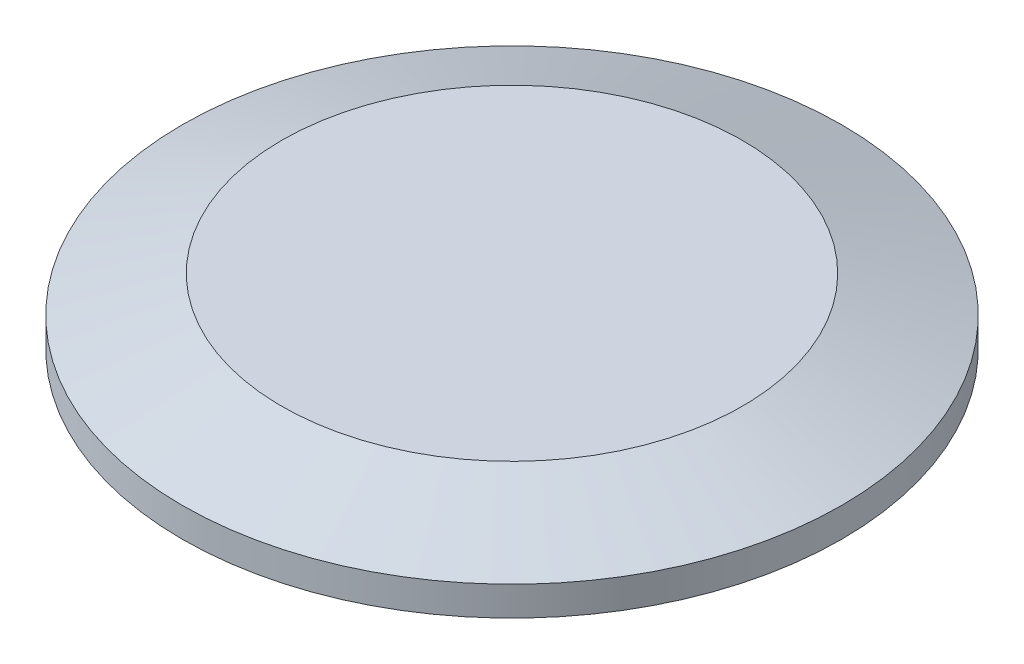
from build123d import *


with BuildPart() as part:
    # Sketch1 → Revolve1 (revolve)
    with BuildSketch(Plane.XY):
        with BuildLine():
            Line((0, 0), (-26.350591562, 0))
            ThreePointArc((-26.350591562, 0), (-26.782788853, 0.129217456), (-27.073133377, 0.474458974))
            ThreePointArc((-27.073133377, 0.474458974), (-28.1686, 1.1938), (-29.264066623, 0.474458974))
            ThreePointArc((-29.264066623, 0.474458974), (-29.554411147, 0.129217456), (-29.986608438, 0))
            Line((-29.986608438, 0), (-31.9532, 0))
            Line((-31.9532, 0), (-31.9532, 2.8448))
            Line((-31.9532, 2.8448), (-22.322742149, 6.35))
            Line((-22.322742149, 6.35), (0, 6.35))
            Line((0, 6.35), (0, 0))
        make_face()
    revolve(axis=Axis((0, 6.35, 0), (0, -1, 0)))


solid = part.part
